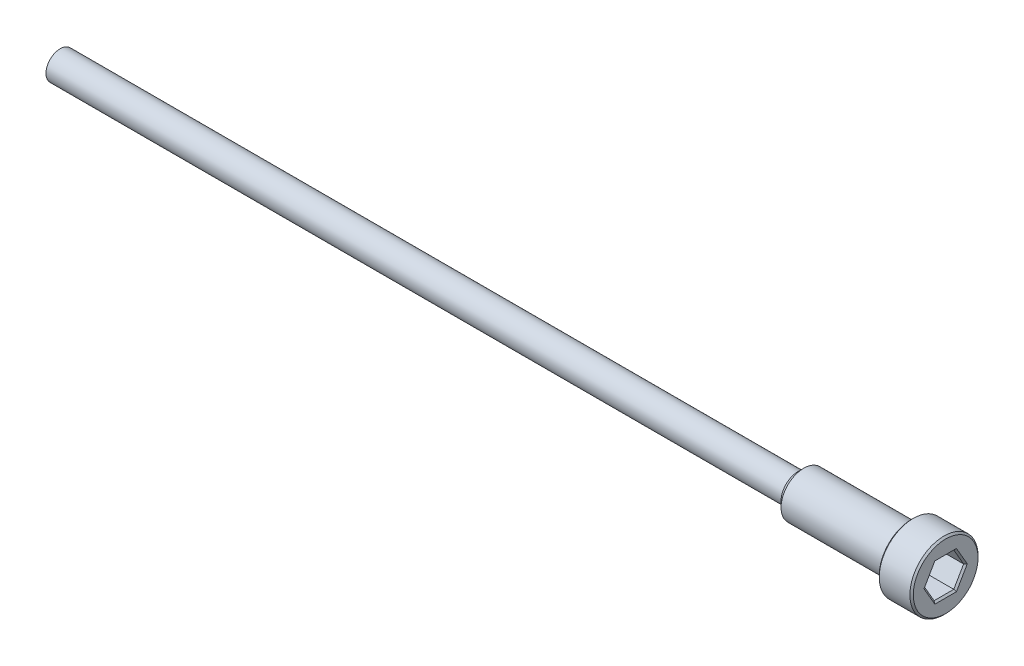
from build123d import *

# Parameters (mm, degrees)
SKETCH1_R          = 2.5
EXTRUDE1_DEPTH     = 130
SKETCH2_R          = 4
EXTRUDE2_DEPTH     = 20
CHAMFER1_SIZE      = 1
SKETCH4_R          = 6
EXTRUDE3_DEPTH     = 6
CUT_EXTRUDE1_DEPTH = 6
CHAMFER2_SIZE      = 0.3


with BuildPart() as part:
    # Sketch1 → Extrude1 (new body)
    with BuildSketch(Plane(origin=(0, 0, 0), x_dir=(0, 0, -1), z_dir=(1, 0, 0))):
        Circle(SKETCH1_R)
    extrude(amount=EXTRUDE1_DEPTH)

    # Sketch2 → Extrude2 (add)
    with BuildSketch(Plane(origin=(130, 0, 0), x_dir=(0, 0, -1), z_dir=(1, 0, 0))):
        Circle(SKETCH2_R)
    extrude(amount=EXTRUDE2_DEPTH)

    # Chamfer1
    chamfer1_edges = [part.edges().sort_by_distance(p)[0] for p in [
        (130, 0, 4),
    ]]
    chamfer(chamfer1_edges, length=CHAMFER1_SIZE)

    # Sketch4 → Extrude3 (add)
    with BuildSketch(Plane(origin=(150, 0, 0), x_dir=(0, 0, -1), z_dir=(1, 0, 0))):
        Circle(SKETCH4_R)
    extrude(amount=EXTRUDE3_DEPTH)

    # Sketch5 → Cut-Extrude1 (cut)
    with BuildSketch(Plane(origin=(156, 0, 0), x_dir=(0, 0, -1), z_dir=(1, 0, 0))):
        Polygon((-1.732050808, 3), (1.732050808, 3), (3.464101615, 0), (1.732050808, -3), (-1.732050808, -3), (-3.464101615, 0), align=None)
    extrude(amount=-CUT_EXTRUDE1_DEPTH, mode=Mode.SUBTRACT)

    # Chamfer2
    chamfer2_edges = [part.edges().sort_by_distance(p)[0] for p in [
        (150, 0, 6),
        (156, 0, 6),
        (156, -1.5, 2.598076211),
        (156, 1.5, 2.598076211),
        (156, 3, 0),
        (156, 1.5, -2.598076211),
        (156, -1.5, -2.598076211),
        (156, -3, 0),
    ]]
    chamfer(chamfer2_edges, length=CHAMFER2_SIZE)


solid = part.part
